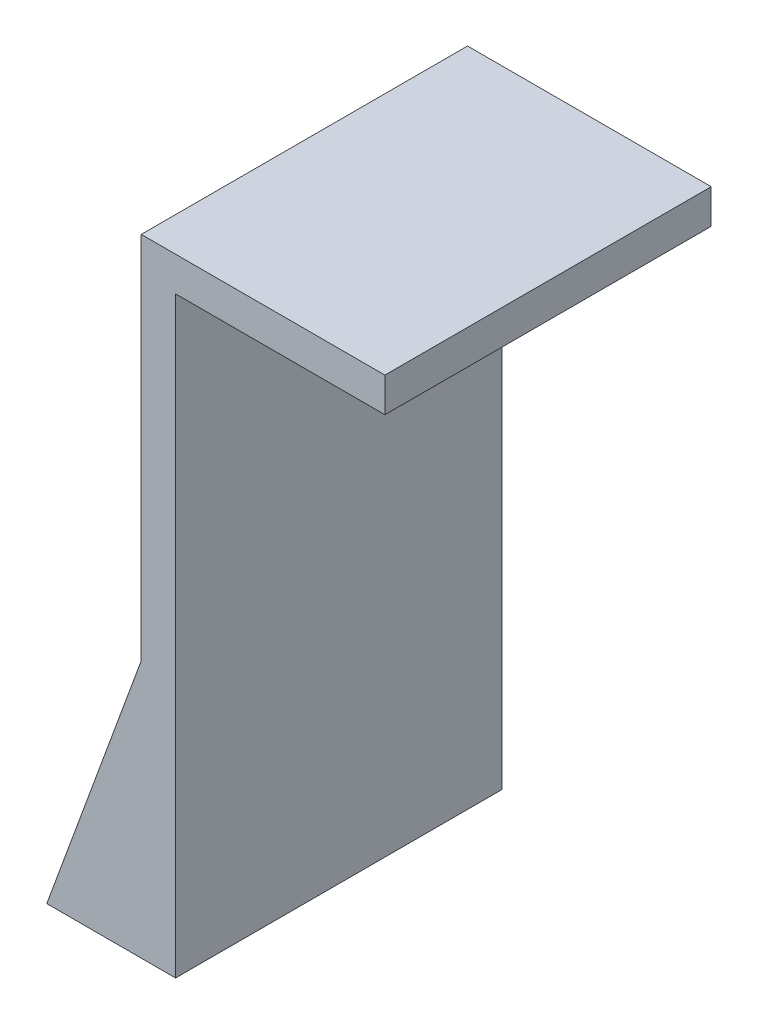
from build123d import *

# Parameters (mm, degrees)
SALIENTE_EXTRUIR1_DEPTH = 19


with BuildPart() as part:
    # Croquis1 → Saliente-Extruir1 (new body)
    with BuildSketch(Plane.XY):
        Polygon((0, 0), (5.5, 15), (5.5, 36.5), (19.689628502, 36.5), (19.689628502, 34.5), (7.5, 34.5), (7.5, 0), align=None)
    extrude(amount=SALIENTE_EXTRUIR1_DEPTH)


solid = part.part
